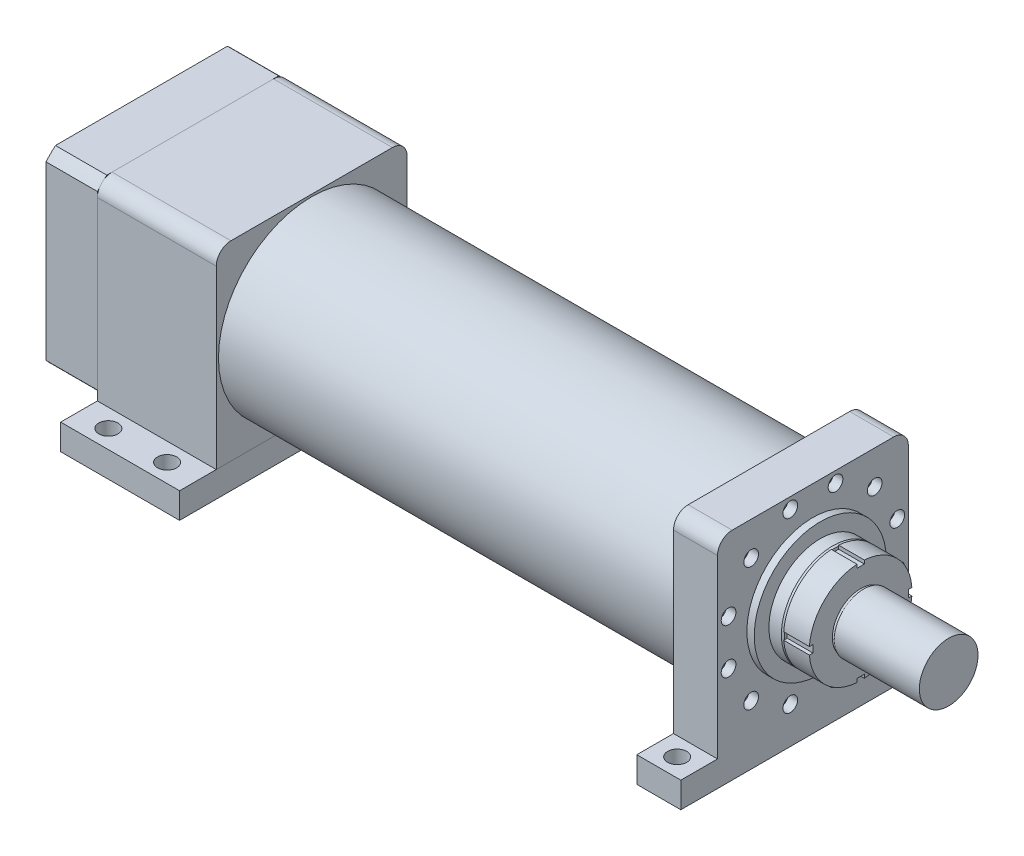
from build123d import *

# Parameters (mm, degrees)
SKETCH_1_R                = 127
SKETCH_1_R_2              = 110
EXTRUDE_1_DEPTH           = 623
SKETCH_2_R                = 6.5
EXTRUDE_2_DEPTH           = 60
SKETCH_3_R                = 90
EXTRUDE_3_DEPTH           = 10
SKETCH_5_R                = 70
EXTRUDE_4_DEPTH           = 20
CHAMFER_1_SIZE            = 3
CHAMFER_1_SIZE2           = 1.091910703
SKETCH_7_R                = 70
EXTRUDE_5_DEPTH           = 35
SKETCH_8_R                = 38.5
EXTRUDE_6_DEPTH           = 4
SKETCH_9_R                = 40
EXTRUDE_7_DEPTH           = 116
SKETCH_10_W               = 10
SKETCH_10_H               = 12.219318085
SKETCH_10_W_2             = 33.965202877
SKETCH_10_H_2             = 10
SKETCH_10_H_3             = 35.687535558
CUT_EXTRUDE_2_DEPTH       = 35
EXTRUDE_8_DEPTH           = 162
EXTRUDE_10_DEPTH          = 70
SKETCH_16_R               = 80
CUT_EXTRUDE_4_DEPTH       = 26
SKETCH_17_R               = 81.5
CUT_EXTRUDE_5_DEPTH       = 38
SKETCH_18_W               = 162
SKETCH_18_H               = 360
SKETCH_18_R               = 13
SKETCH_18_W_2             = 60
EXTRUDE_11_DEPTH          = 35
SKETCH_20_W               = 10
SKETCH_20_H               = 13
HOLE_WIZARD_1_AT_2_COUNT  = 2
HOLE_WIZARD_1_AT_2_PITCH  = 61.598932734
HOLE_WIZARD_1_AT_3_COUNT  = 2
HOLE_WIZARD_1_AT_3_PITCH  = 119
HOLE_WIZARD_1_AT_4_COUNT  = 2
HOLE_WIZARD_1_AT_4_PITCH  = 168.291413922
HOLE_WIZARD_1_AT_5_COUNT  = 2
HOLE_WIZARD_1_AT_5_PITCH  = 206.114046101
HOLE_WIZARD_1_AT_6_COUNT  = 2
HOLE_WIZARD_1_AT_6_PITCH  = 229.890346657
HOLE_WIZARD_1_AT_7_COUNT  = 2
HOLE_WIZARD_1_AT_7_PITCH  = 238
HOLE_WIZARD_1_AT_8_COUNT  = 2
HOLE_WIZARD_1_AT_8_PITCH  = 229.890346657
HOLE_WIZARD_1_AT_9_COUNT  = 2
HOLE_WIZARD_1_AT_9_PITCH  = 206.114046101
HOLE_WIZARD_1_AT_10_COUNT = 2
HOLE_WIZARD_1_AT_10_PITCH = 168.291413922
HOLE_WIZARD_1_AT_11_COUNT = 2
HOLE_WIZARD_1_AT_11_PITCH = 119
HOLE_WIZARD_1_AT_12_COUNT = 2
HOLE_WIZARD_1_AT_12_PITCH = 61.598932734


with BuildPart() as part:
    # Sketch 1 → Extrude 1 (new body)
    with BuildSketch(Plane(origin=(0, 0, 0), x_dir=(0, 0, -1), z_dir=(1, 0, 0))):
        Circle(SKETCH_1_R)
        Circle(SKETCH_1_R_2, mode=Mode.SUBTRACT)
    extrude(amount=EXTRUDE_1_DEPTH)


with BuildPart() as body_2:
    # Sketch 2 → Extrude 2 (new body)
    with BuildSketch(Plane(origin=(623, 0, 0), x_dir=(0, 0, -1), z_dir=(1, 0, 0))):
        with BuildLine():
            Line((-110, 130), (110, 130))
            ThreePointArc((110, 130), (124.142135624, 124.142135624), (130, 110))
            Line((130, 110), (130, -110))
            Line((130, -110), (130, -130))
            Line((130, -130), (110, -130))
            Line((110, -130), (-110, -130))
            Line((-110, -130), (-130, -130))
            Line((-130, -130), (-130, -110))
            Line((-130, -110), (-130, 110))
            ThreePointArc((-130, 110), (-124.142135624, 124.142135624), (-110, 130))
        make_face()
        with Locations((30.799466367, 114.945173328)):
            Circle(SKETCH_2_R, mode=Mode.SUBTRACT)
        with Locations((84.145706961, 84.145706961)):
            Circle(SKETCH_2_R, mode=Mode.SUBTRACT)
        with Locations((114.945173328, 30.799466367)):
            Circle(SKETCH_2_R, mode=Mode.SUBTRACT)
        with Locations((114.945173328, -30.799466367)):
            Circle(SKETCH_2_R, mode=Mode.SUBTRACT)
        with Locations((84.145706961, -84.145706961)):
            Circle(SKETCH_2_R, mode=Mode.SUBTRACT)
        with Locations((30.799466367, -114.945173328)):
            Circle(SKETCH_2_R, mode=Mode.SUBTRACT)
        with Locations((-30.799466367, -114.945173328)):
            Circle(SKETCH_2_R, mode=Mode.SUBTRACT)
        with Locations((-84.145706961, -84.145706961)):
            Circle(SKETCH_2_R, mode=Mode.SUBTRACT)
        with Locations((-114.945173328, -30.799466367)):
            Circle(SKETCH_2_R, mode=Mode.SUBTRACT)
        with Locations((-114.945173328, 30.799466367)):
            Circle(SKETCH_2_R, mode=Mode.SUBTRACT)
        with Locations((-84.145706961, 84.145706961)):
            Circle(SKETCH_2_R, mode=Mode.SUBTRACT)
        with Locations((-30.799466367, 114.945173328)):
            Circle(SKETCH_2_R, mode=Mode.SUBTRACT)
    extrude(amount=EXTRUDE_2_DEPTH)

    # Sketch 3 → Extrude 3 (add)
    with BuildSketch(Plane(origin=(683, 0, 0), x_dir=(0, 0, -1), z_dir=(1, 0, 0))):
        Circle(SKETCH_3_R)
    extrude(amount=EXTRUDE_3_DEPTH)

    # Sketch 5 → Extrude 4 (add)
    with BuildSketch(Plane(origin=(693, 0, 0), x_dir=(0, 0, -1), z_dir=(1, 0, 0))):
        Circle(SKETCH_5_R)
    extrude(amount=EXTRUDE_4_DEPTH)

    # Chamfer 1
    chamfer_1_edges = [body_2.edges().sort_by_distance(p)[0] for p in [
        (713, 0, 70),
    ]]
    chamfer_1_side = [body_2.faces().sort_by_distance(p)[0] for p in [
        (703, 0, 70),
    ]]
    chamfer(chamfer_1_edges, length=CHAMFER_1_SIZE, length2=CHAMFER_1_SIZE2, reference=chamfer_1_side[0])

    # Sketch 7 → Extrude 5 (add)
    with BuildSketch(Plane(origin=(713, 0, 0), x_dir=(0, 0, -1), z_dir=(1, 0, 0))):
        Circle(SKETCH_7_R)
    extrude(amount=EXTRUDE_5_DEPTH)

    # Sketch 8 → Extrude 6 (add)
    with BuildSketch(Plane(origin=(748, 0, 0), x_dir=(0, 0, -1), z_dir=(1, 0, 0))):
        Circle(SKETCH_8_R)
    extrude(amount=EXTRUDE_6_DEPTH)

    # Sketch 9 → Extrude 7 (add)
    with BuildSketch(Plane(origin=(752, 0, 0), x_dir=(0, 0, -1), z_dir=(1, 0, 0))):
        with Locations(Location((0, 0, 0), (0, 0, 180))):
            Circle(SKETCH_9_R)
    extrude(amount=EXTRUDE_7_DEPTH)

    # Sketch 10 → Cut-Extrude 2 (cut)
    with BuildSketch(Plane(origin=(748, 0, 0), x_dir=(0, 0, -1), z_dir=(1, 0, 0))):
        with Locations((0, -71.109659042)):
            Rectangle(SKETCH_10_W, SKETCH_10_H)
        Polygon((-76.465931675, 5), (-65, 5), (-65, -5), (-79.460488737, -5), align=None)
        with Locations((81.982601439, 0)):
            Rectangle(SKETCH_10_W_2, SKETCH_10_H_2)
        with Locations((0, 82.843767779)):
            Rectangle(SKETCH_10_W, SKETCH_10_H_3)
    extrude(amount=-CUT_EXTRUDE_2_DEPTH, mode=Mode.SUBTRACT)

    # Sketch 18 → Extrude 11 (add)
    # profile 1 of 2: a face of its own
    with BuildSketch(Plane.XZ.offset(130)):
        with Locations((-81, 0)):
            Rectangle(SKETCH_18_W, SKETCH_18_H)
        with Locations(Location((-122, 155, 0), (0, 0, 270))):
            Circle(SKETCH_18_R, mode=Mode.SUBTRACT)
        with Locations(Location((-42, 155, 0), (0, 0, 270))):
            Circle(SKETCH_18_R, mode=Mode.SUBTRACT)
        with Locations(Location((-122, -155, 0), (0, 0, 270))):
            Circle(SKETCH_18_R, mode=Mode.SUBTRACT)
        with Locations(Location((-42, -155, 0), (0, 0, 270))):
            Circle(SKETCH_18_R, mode=Mode.SUBTRACT)
    # profile 2 of 2: a face of its own
    with BuildSketch(Plane.XZ.offset(130)):
        with Locations((653, 0)):
            Rectangle(SKETCH_18_W_2, SKETCH_18_H)
        with Locations(Location((653, 155, 0), (0, 0, 270))):
            Circle(SKETCH_18_R, mode=Mode.SUBTRACT)
        with Locations(Location((653, -155, 0), (0, 0, 270))):
            Circle(SKETCH_18_R, mode=Mode.SUBTRACT)
    extrude(amount=EXTRUDE_11_DEPTH)


with BuildPart() as body_3:
    # Sketch 11 → Extrude 8 (new body)
    with BuildSketch(Plane.ZY):
        with BuildLine():
            Line((130, -110), (130, -130))
            Line((130, -130), (110, -130))
            Line((110, -130), (-110, -130))
            Line((-110, -130), (-130, -130))
            Line((-130, -130), (-130, -110))
            Line((-130, -110), (-130, 110))
            ThreePointArc((-130, 110), (-124.142135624, 124.142135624), (-110, 130))
            Line((-110, 130), (110, 130))
            ThreePointArc((110, 130), (124.142135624, 124.142135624), (130, 110))
            Line((130, 110), (130, -110))
        make_face()
    extrude(amount=EXTRUDE_8_DEPTH)


with BuildPart() as body_4:
    # Sketch 15 → Extrude 10 (new body)
    with BuildSketch(Plane.ZY.offset(162)):
        with BuildLine():
            Line((-117.153745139, 130), (117.153745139, 130))
            ThreePointArc((117.153745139, 130), (123.743686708, 123.743686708), (130, 117.153745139))
            Line((130, 117.153745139), (130, -117.153745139))
            ThreePointArc((130, -117.153745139), (123.743686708, -123.743686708), (117.153745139, -130))
            Line((117.153745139, -130), (-117.153745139, -130))
            ThreePointArc((-117.153745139, -130), (-123.743686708, -123.743686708), (-130, -117.153745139))
            Line((-130, -117.153745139), (-130, 117.153745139))
            ThreePointArc((-130, 117.153745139), (-123.743686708, 123.743686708), (-117.153745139, 130))
        make_face()
    extrude(amount=EXTRUDE_10_DEPTH)

    # Sketch 16 → Cut-Extrude 4 (cut)
    with BuildSketch(Plane.ZY.offset(232)):
        Circle(SKETCH_16_R)
    extrude(amount=-CUT_EXTRUDE_4_DEPTH, mode=Mode.SUBTRACT)

    # Sketch 17 → Cut-Extrude 5 (cut)
    with BuildSketch(Plane.ZY.offset(206)):
        Circle(SKETCH_17_R)
    extrude(amount=-CUT_EXTRUDE_5_DEPTH, mode=Mode.SUBTRACT)


with BuildPart() as extrude_11_piece_1:
    # of the separate pieces the step leaves, piece 1, a body of its own (extrude_11_pieces)
    add(body_2.part.solids().sort_by_distance((623, -130, 180))[0])

    # Sketch 20 → Hole Wizard 1 (revolve, cut)
    with BuildSketch(Plane(origin=(683, 84.145706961, 84.145706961), x_dir=(0, 0, -1), z_dir=(0, 1, 0))):
        with Locations((5, 6.5)):
            Rectangle(SKETCH_20_W, SKETCH_20_H)
    hole_wizard_1 = revolve(axis=Axis((573, 84.145706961, 84.145706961), (1, 0, 0)), mode=Mode.SUBTRACT)

    # Hole Wizard 1 at 2: Hole Wizard 1 ×2
    with Locations(*[Vector(0, 0.5000000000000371, -0.8660254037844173) * (i * HOLE_WIZARD_1_AT_2_PITCH) for i in range(1, HOLE_WIZARD_1_AT_2_COUNT)]):
        add(hole_wizard_1, mode=Mode.SUBTRACT)

    # Hole Wizard 1 at 3: Hole Wizard 1 ×2
    with Locations(*[Vector(0, 0.25881904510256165, -0.9659258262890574) * (i * HOLE_WIZARD_1_AT_3_PITCH) for i in range(1, HOLE_WIZARD_1_AT_3_COUNT)]):
        add(hole_wizard_1, mode=Mode.SUBTRACT)

    # Hole Wizard 1 at 4: Hole Wizard 1 ×2
    with Locations(*[(0, 0, -i * HOLE_WIZARD_1_AT_4_PITCH) for i in range(1, HOLE_WIZARD_1_AT_4_COUNT)]):
        add(hole_wizard_1, mode=Mode.SUBTRACT)

    # Hole Wizard 1 at 5: Hole Wizard 1 ×2
    with Locations(*[Vector(0, -0.25881904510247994, -0.9659258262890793) * (i * HOLE_WIZARD_1_AT_5_PITCH) for i in range(1, HOLE_WIZARD_1_AT_5_COUNT)]):
        add(hole_wizard_1, mode=Mode.SUBTRACT)

    # Hole Wizard 1 at 6: Hole Wizard 1 ×2
    with Locations(*[Vector(0, -0.4999999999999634, -0.8660254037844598) * (i * HOLE_WIZARD_1_AT_6_PITCH) for i in range(1, HOLE_WIZARD_1_AT_6_COUNT)]):
        add(hole_wizard_1, mode=Mode.SUBTRACT)

    # Hole Wizard 1 at 7: Hole Wizard 1 ×2
    with Locations(*[Vector(0, -0.7071067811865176, -0.7071067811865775) * (i * HOLE_WIZARD_1_AT_7_PITCH) for i in range(1, HOLE_WIZARD_1_AT_7_COUNT)]):
        add(hole_wizard_1, mode=Mode.SUBTRACT)

    # Hole Wizard 1 at 8: Hole Wizard 1 ×2
    with Locations(*[Vector(0, -0.8660254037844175, -0.5000000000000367) * (i * HOLE_WIZARD_1_AT_8_PITCH) for i in range(1, HOLE_WIZARD_1_AT_8_COUNT)]):
        add(hole_wizard_1, mode=Mode.SUBTRACT)

    # Hole Wizard 1 at 9: Hole Wizard 1 ×2
    with Locations(*[Vector(0, -0.9659258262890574, -0.2588190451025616) * (i * HOLE_WIZARD_1_AT_9_PITCH) for i in range(1, HOLE_WIZARD_1_AT_9_COUNT)]):
        add(hole_wizard_1, mode=Mode.SUBTRACT)

    # Hole Wizard 1 at 10: Hole Wizard 1 ×2
    with Locations(*[(0, -i * HOLE_WIZARD_1_AT_10_PITCH, 0) for i in range(1, HOLE_WIZARD_1_AT_10_COUNT)]):
        add(hole_wizard_1, mode=Mode.SUBTRACT)

    # Hole Wizard 1 at 11: Hole Wizard 1 ×2
    with Locations(*[Vector(0, -0.9659258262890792, 0.25881904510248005) * (i * HOLE_WIZARD_1_AT_11_PITCH) for i in range(1, HOLE_WIZARD_1_AT_11_COUNT)]):
        add(hole_wizard_1, mode=Mode.SUBTRACT)

    # Hole Wizard 1 at 12: Hole Wizard 1 ×2
    with Locations(*[Vector(0, -0.8660254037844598, 0.49999999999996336) * (i * HOLE_WIZARD_1_AT_12_PITCH) for i in range(1, HOLE_WIZARD_1_AT_12_COUNT)]):
        add(hole_wizard_1, mode=Mode.SUBTRACT)


with BuildPart() as extrude_11_piece_2:
    # of the separate pieces the step leaves, piece 2, a body of its own (extrude_11_pieces)
    add(body_2.part.solids().sort_by_distance((-162, -130, 180))[0])


solid = Compound([part.part, body_3.part, body_4.part, extrude_11_piece_1.part, extrude_11_piece_2.part])
